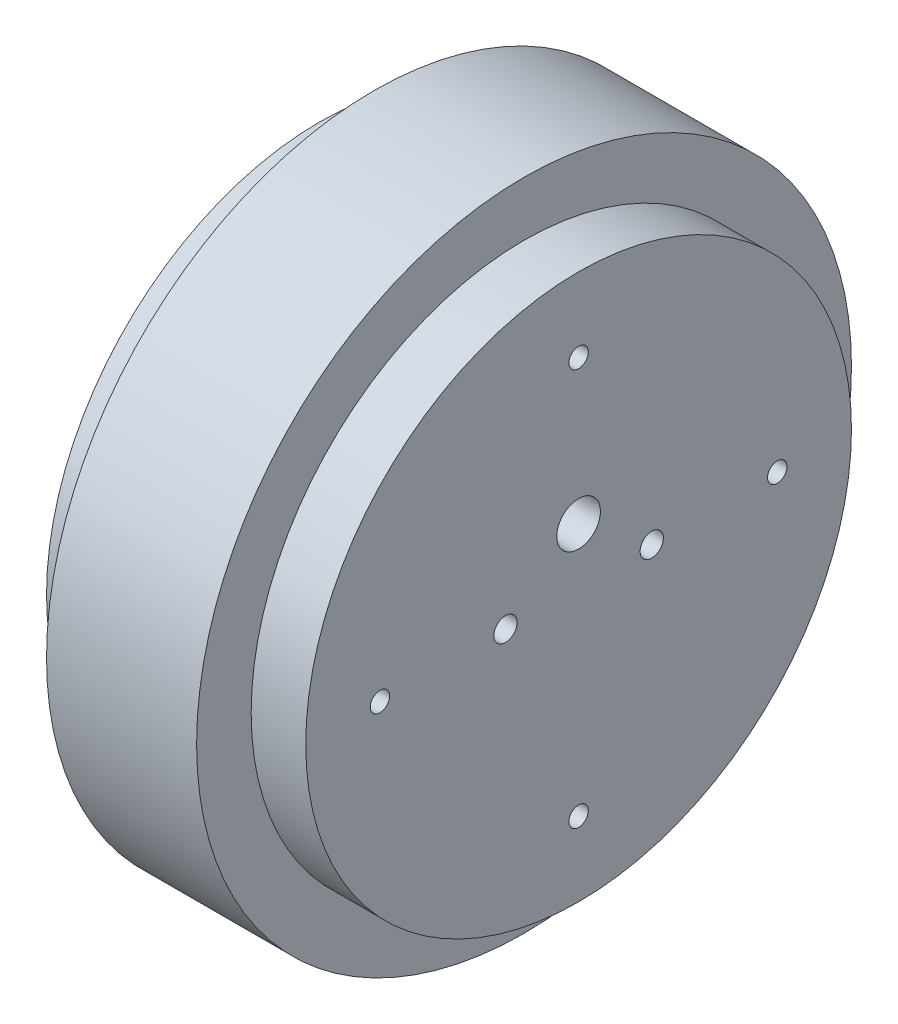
ISO-10303-21;
HEADER;
FILE_DESCRIPTION(('STEP AP214'),'2;1');
FILE_NAME('part.step','',(''),(''),'','','');
FILE_SCHEMA(('AUTOMOTIVE_DESIGN { 1 0 10303 214 1 1 1 1 }'));
ENDSEC;
DATA;
#1=APPLICATION_CONTEXT('core data for automotive mechanical design processes');
#2=APPLICATION_PROTOCOL_DEFINITION('international standard','automotive_design',2000,#1);
#3=PRODUCT_CONTEXT('',#1,'mechanical');
#4=PRODUCT('Part','Part','',(#3));
#5=PRODUCT_RELATED_PRODUCT_CATEGORY('part','',(#4));
#6=PRODUCT_DEFINITION_FORMATION('','',#4);
#7=PRODUCT_DEFINITION_CONTEXT('part definition',#1,'design');
#8=PRODUCT_DEFINITION('design','',#6,#7);
#9=PRODUCT_DEFINITION_SHAPE('','',#8);
#10=(LENGTH_UNIT() NAMED_UNIT(*) SI_UNIT(.MILLI.,.METRE.));
#11=(NAMED_UNIT(*) PLANE_ANGLE_UNIT() SI_UNIT($,.RADIAN.));
#12=(NAMED_UNIT(*) SI_UNIT($,.STERADIAN.) SOLID_ANGLE_UNIT());
#13=UNCERTAINTY_MEASURE_WITH_UNIT(LENGTH_MEASURE(1.E-05),#10,'distance_accuracy_value','');
#14=(GEOMETRIC_REPRESENTATION_CONTEXT(3) GLOBAL_UNCERTAINTY_ASSIGNED_CONTEXT((#13)) GLOBAL_UNIT_ASSIGNED_CONTEXT((#10,
#11,#12)) REPRESENTATION_CONTEXT('',''));
#15=CARTESIAN_POINT('',(0.,0.,0.));
#16=DIRECTION('',(0.,0.,1.));
#17=DIRECTION('',(1.,0.,0.));
#18=AXIS2_PLACEMENT_3D('',#15,#16,#17);
#19=CARTESIAN_POINT('',(-4.7625,0.,0.));
#20=DIRECTION('',(-1.,0.,0.));
#21=DIRECTION('',(0.,0.,1.));
#22=AXIS2_PLACEMENT_3D('',#19,#20,#21);
#23=CYLINDRICAL_SURFACE('',#22,27.5336);
#24=CARTESIAN_POINT('',(-11.1125,0.,0.));
#25=DIRECTION('',(-1.,0.,0.));
#26=DIRECTION('',(0.,0.,1.));
#27=AXIS2_PLACEMENT_3D('',#24,#25,#26);
#28=CIRCLE('',#27,27.5336);
#29=CARTESIAN_POINT('',(-11.1125,0.,27.5336));
#30=VERTEX_POINT('',#29);
#31=EDGE_CURVE('E86',#30,#30,#28,.T.);
#32=ORIENTED_EDGE('',*,*,#31,.T.);
#33=EDGE_LOOP('',(#32));
#34=FACE_BOUND('',#33,.T.);
#35=CARTESIAN_POINT('',(-9.7917,0.,0.));
#36=DIRECTION('',(-1.,0.,0.));
#37=DIRECTION('',(0.,0.,1.));
#38=AXIS2_PLACEMENT_3D('',#35,#36,#37);
#39=CIRCLE('',#38,27.5336);
#40=CARTESIAN_POINT('',(-9.7917,0.,27.5336));
#41=VERTEX_POINT('',#40);
#42=EDGE_CURVE('E10',#41,#41,#39,.T.);
#43=ORIENTED_EDGE('',*,*,#42,.F.);
#44=EDGE_LOOP('',(#43));
#45=FACE_BOUND('',#44,.T.);
#46=ADVANCED_FACE('F40',(#34,#45),#23,.F.);
#47=CARTESIAN_POINT('',(-9.7917,0.,0.));
#48=DIRECTION('',(-1.,0.,0.));
#49=DIRECTION('',(0.,0.,1.));
#50=AXIS2_PLACEMENT_3D('',#47,#48,#49);
#51=PLANE('',#50);
#52=ORIENTED_EDGE('',*,*,#42,.T.);
#53=EDGE_LOOP('',(#52));
#54=FACE_BOUND('',#53,.T.);
#55=CARTESIAN_POINT('',(-9.7917,0.,0.));
#56=DIRECTION('',(-1.,0.,0.));
#57=DIRECTION('',(0.,0.,1.));
#58=AXIS2_PLACEMENT_3D('',#55,#56,#57);
#59=CIRCLE('',#58,25.4);
#60=CARTESIAN_POINT('',(-9.7917,0.,25.4));
#61=VERTEX_POINT('',#60);
#62=EDGE_CURVE('E46',#61,#61,#59,.T.);
#63=ORIENTED_EDGE('',*,*,#62,.F.);
#64=EDGE_LOOP('',(#63));
#65=FACE_BOUND('',#64,.T.);
#66=ADVANCED_FACE('F160',(#54,#65),#51,.T.);
#67=CARTESIAN_POINT('',(-4.7625,0.,0.));
#68=DIRECTION('',(-1.,0.,0.));
#69=DIRECTION('',(0.,0.,1.));
#70=AXIS2_PLACEMENT_3D('',#67,#68,#69);
#71=CYLINDRICAL_SURFACE('',#70,25.4);
#72=ORIENTED_EDGE('',*,*,#62,.T.);
#73=EDGE_LOOP('',(#72));
#74=FACE_BOUND('',#73,.T.);
#75=CARTESIAN_POINT('',(-11.1125,0.,0.));
#76=DIRECTION('',(-1.,0.,0.));
#77=DIRECTION('',(0.,0.,1.));
#78=AXIS2_PLACEMENT_3D('',#75,#76,#77);
#79=CIRCLE('',#78,25.4);
#80=CARTESIAN_POINT('',(-11.1125,0.,25.4));
#81=VERTEX_POINT('',#80);
#82=EDGE_CURVE('E50',#81,#81,#79,.T.);
#83=ORIENTED_EDGE('',*,*,#82,.F.);
#84=EDGE_LOOP('',(#83));
#85=FACE_BOUND('',#84,.T.);
#86=ADVANCED_FACE('F154',(#74,#85),#71,.T.);
#87=CARTESIAN_POINT('',(-11.1125,0.,0.));
#88=DIRECTION('',(1.,0.,0.));
#89=DIRECTION('',(0.,0.,-1.));
#90=AXIS2_PLACEMENT_3D('',#87,#88,#89);
#91=PLANE('',#90);
#92=CARTESIAN_POINT('',(-11.1125,0.,0.));
#93=DIRECTION('',(-1.,0.,0.));
#94=DIRECTION('',(0.,0.,1.));
#95=AXIS2_PLACEMENT_3D('',#92,#93,#94);
#96=CIRCLE('',#95,22.86);
#97=CARTESIAN_POINT('',(-11.1125,0.,22.86));
#98=VERTEX_POINT('',#97);
#99=EDGE_CURVE('E54',#98,#98,#96,.T.);
#100=ORIENTED_EDGE('',*,*,#99,.F.);
#101=EDGE_LOOP('',(#100));
#102=FACE_BOUND('',#101,.T.);
#103=ORIENTED_EDGE('',*,*,#82,.T.);
#104=EDGE_LOOP('',(#103));
#105=FACE_BOUND('',#104,.T.);
#106=ADVANCED_FACE('F148',(#102,#105),#91,.F.);
#107=CARTESIAN_POINT('',(-4.7625,0.,0.));
#108=DIRECTION('',(-1.,0.,0.));
#109=DIRECTION('',(0.,0.,1.));
#110=AXIS2_PLACEMENT_3D('',#107,#108,#109);
#111=CYLINDRICAL_SURFACE('',#110,22.86);
#112=CARTESIAN_POINT('',(-4.7625,0.,0.));
#113=DIRECTION('',(-1.,0.,0.));
#114=DIRECTION('',(0.,0.,1.));
#115=AXIS2_PLACEMENT_3D('',#112,#113,#114);
#116=CIRCLE('',#115,22.86);
#117=CARTESIAN_POINT('',(-4.7625,0.,22.86));
#118=VERTEX_POINT('',#117);
#119=EDGE_CURVE('E59',#118,#118,#116,.T.);
#120=ORIENTED_EDGE('',*,*,#119,.F.);
#121=EDGE_LOOP('',(#120));
#122=FACE_BOUND('',#121,.T.);
#123=ORIENTED_EDGE('',*,*,#99,.T.);
#124=EDGE_LOOP('',(#123));
#125=FACE_BOUND('',#124,.T.);
#126=ADVANCED_FACE('F138',(#122,#125),#111,.F.);
#127=CARTESIAN_POINT('',(-4.7625,0.,0.));
#128=DIRECTION('',(1.,0.,0.));
#129=DIRECTION('',(0.,0.,-1.));
#130=AXIS2_PLACEMENT_3D('',#127,#128,#129);
#131=PLANE('',#130);
#132=CARTESIAN_POINT('',(-4.7625,0.,-8.509));
#133=DIRECTION('',(-1.,0.,0.));
#134=DIRECTION('',(0.,0.,1.));
#135=AXIS2_PLACEMENT_3D('',#132,#133,#134);
#136=CIRCLE('',#135,1.35255);
#137=CARTESIAN_POINT('',(-4.7625,0.,-7.15645));
#138=VERTEX_POINT('',#137);
#139=EDGE_CURVE('E128',#138,#138,#136,.T.);
#140=ORIENTED_EDGE('',*,*,#139,.F.);
#141=EDGE_LOOP('',(#140));
#142=FACE_BOUND('',#141,.T.);
#143=CARTESIAN_POINT('',(-4.7625,0.,8.509));
#144=DIRECTION('',(-1.,0.,0.));
#145=DIRECTION('',(0.,0.,1.));
#146=AXIS2_PLACEMENT_3D('',#143,#144,#145);
#147=CIRCLE('',#146,1.35255);
#148=CARTESIAN_POINT('',(-4.7625,0.,9.86155));
#149=VERTEX_POINT('',#148);
#150=EDGE_CURVE('E122',#149,#149,#147,.T.);
#151=ORIENTED_EDGE('',*,*,#150,.F.);
#152=EDGE_LOOP('',(#151));
#153=FACE_BOUND('',#152,.T.);
#154=CARTESIAN_POINT('',(-4.7625,6.35,0.));
#155=DIRECTION('',(-1.,0.,0.));
#156=DIRECTION('',(0.,0.,1.));
#157=AXIS2_PLACEMENT_3D('',#154,#155,#156);
#158=CIRCLE('',#157,2.54);
#159=CARTESIAN_POINT('',(-4.7625,6.35,2.54));
#160=VERTEX_POINT('',#159);
#161=EDGE_CURVE('E92',#160,#160,#158,.T.);
#162=ORIENTED_EDGE('',*,*,#161,.F.);
#163=EDGE_LOOP('',(#162));
#164=FACE_BOUND('',#163,.T.);
#165=ORIENTED_EDGE('',*,*,#119,.T.);
#166=EDGE_LOOP('',(#165));
#167=FACE_BOUND('',#166,.T.);
#168=ADVANCED_FACE('F134',(#142,#153,#164,#167),#131,.F.);
#169=CARTESIAN_POINT('',(0.,0.,0.));
#170=DIRECTION('',(-1.,0.,0.));
#171=DIRECTION('',(0.,0.,1.));
#172=AXIS2_PLACEMENT_3D('',#169,#170,#171);
#173=PLANE('',#172);
#174=CARTESIAN_POINT('',(0.,0.,-8.509));
#175=DIRECTION('',(-1.,0.,0.));
#176=DIRECTION('',(0.,0.,1.));
#177=AXIS2_PLACEMENT_3D('',#174,#175,#176);
#178=CIRCLE('',#177,1.35255);
#179=CARTESIAN_POINT('',(0.,0.,-7.15645));
#180=VERTEX_POINT('',#179);
#181=EDGE_CURVE('E125',#180,#180,#178,.T.);
#182=ORIENTED_EDGE('',*,*,#181,.T.);
#183=EDGE_LOOP('',(#182));
#184=FACE_BOUND('',#183,.T.);
#185=CARTESIAN_POINT('',(0.,0.,8.509));
#186=DIRECTION('',(-1.,0.,0.));
#187=DIRECTION('',(0.,0.,1.));
#188=AXIS2_PLACEMENT_3D('',#185,#186,#187);
#189=CIRCLE('',#188,1.35255);
#190=CARTESIAN_POINT('',(0.,0.,9.86155));
#191=VERTEX_POINT('',#190);
#192=EDGE_CURVE('E119',#191,#191,#189,.T.);
#193=ORIENTED_EDGE('',*,*,#192,.T.);
#194=EDGE_LOOP('',(#193));
#195=FACE_BOUND('',#194,.T.);
#196=CARTESIAN_POINT('',(0.,23.114,0.));
#197=DIRECTION('',(1.,0.,0.));
#198=DIRECTION('',(0.,0.,-1.));
#199=AXIS2_PLACEMENT_3D('',#196,#197,#198);
#200=CIRCLE('',#199,1.1303);
#201=CARTESIAN_POINT('',(0.,23.114,-1.1303));
#202=VERTEX_POINT('',#201);
#203=EDGE_CURVE('E116',#202,#202,#200,.T.);
#204=ORIENTED_EDGE('',*,*,#203,.F.);
#205=EDGE_LOOP('',(#204));
#206=FACE_BOUND('',#205,.T.);
#207=CARTESIAN_POINT('',(0.,0.,-23.114));
#208=DIRECTION('',(1.,0.,0.));
#209=DIRECTION('',(0.,0.,-1.));
#210=AXIS2_PLACEMENT_3D('',#207,#208,#209);
#211=CIRCLE('',#210,1.1303);
#212=CARTESIAN_POINT('',(0.,0.,-24.2443));
#213=VERTEX_POINT('',#212);
#214=EDGE_CURVE('E110',#213,#213,#211,.T.);
#215=ORIENTED_EDGE('',*,*,#214,.F.);
#216=EDGE_LOOP('',(#215));
#217=FACE_BOUND('',#216,.T.);
#218=CARTESIAN_POINT('',(0.,-23.114,0.));
#219=DIRECTION('',(1.,0.,0.));
#220=DIRECTION('',(0.,0.,-1.));
#221=AXIS2_PLACEMENT_3D('',#218,#219,#220);
#222=CIRCLE('',#221,1.1303);
#223=CARTESIAN_POINT('',(0.,-23.114,-1.1303));
#224=VERTEX_POINT('',#223);
#225=EDGE_CURVE('E104',#224,#224,#222,.T.);
#226=ORIENTED_EDGE('',*,*,#225,.F.);
#227=EDGE_LOOP('',(#226));
#228=FACE_BOUND('',#227,.T.);
#229=CARTESIAN_POINT('',(0.,0.,23.114));
#230=DIRECTION('',(1.,0.,0.));
#231=DIRECTION('',(0.,0.,-1.));
#232=AXIS2_PLACEMENT_3D('',#229,#230,#231);
#233=CIRCLE('',#232,1.1303);
#234=CARTESIAN_POINT('',(0.,0.,21.9837));
#235=VERTEX_POINT('',#234);
#236=EDGE_CURVE('E98',#235,#235,#233,.T.);
#237=ORIENTED_EDGE('',*,*,#236,.F.);
#238=EDGE_LOOP('',(#237));
#239=FACE_BOUND('',#238,.T.);
#240=CARTESIAN_POINT('',(0.,6.35,0.));
#241=DIRECTION('',(-1.,0.,0.));
#242=DIRECTION('',(0.,0.,1.));
#243=AXIS2_PLACEMENT_3D('',#240,#241,#242);
#244=CIRCLE('',#243,2.54);
#245=CARTESIAN_POINT('',(0.,6.35,2.54));
#246=VERTEX_POINT('',#245);
#247=EDGE_CURVE('E89',#246,#246,#244,.F.);
#248=ORIENTED_EDGE('',*,*,#247,.F.);
#249=EDGE_LOOP('',(#248));
#250=FACE_BOUND('',#249,.T.);
#251=CARTESIAN_POINT('',(0.,0.,0.));
#252=DIRECTION('',(-1.,0.,0.));
#253=DIRECTION('',(0.,0.,1.));
#254=AXIS2_PLACEMENT_3D('',#251,#252,#253);
#255=CIRCLE('',#254,31.75);
#256=CARTESIAN_POINT('',(0.,0.,31.75));
#257=VERTEX_POINT('',#256);
#258=EDGE_CURVE('E62',#257,#257,#255,.T.);
#259=ORIENTED_EDGE('',*,*,#258,.F.);
#260=EDGE_LOOP('',(#259));
#261=FACE_BOUND('',#260,.T.);
#262=ADVANCED_FACE('F137',(#184,#195,#206,#217,#228,#239,#250,#261),#173,.F.);
#263=CARTESIAN_POINT('',(-4.7625,0.,0.));
#264=DIRECTION('',(-1.,0.,0.));
#265=DIRECTION('',(0.,0.,1.));
#266=AXIS2_PLACEMENT_3D('',#263,#264,#265);
#267=CYLINDRICAL_SURFACE('',#266,31.75);
#268=CARTESIAN_POINT('',(-6.35,0.,0.));
#269=DIRECTION('',(-1.,0.,0.));
#270=DIRECTION('',(0.,0.,1.));
#271=AXIS2_PLACEMENT_3D('',#268,#269,#270);
#272=CIRCLE('',#271,31.75);
#273=CARTESIAN_POINT('',(-6.35,0.,31.75));
#274=VERTEX_POINT('',#273);
#275=EDGE_CURVE('E65',#274,#274,#272,.T.);
#276=ORIENTED_EDGE('',*,*,#275,.F.);
#277=EDGE_LOOP('',(#276));
#278=FACE_BOUND('',#277,.T.);
#279=ORIENTED_EDGE('',*,*,#258,.T.);
#280=EDGE_LOOP('',(#279));
#281=FACE_BOUND('',#280,.T.);
#282=ADVANCED_FACE('F210',(#278,#281),#267,.T.);
#283=CARTESIAN_POINT('',(-6.35,0.,0.));
#284=DIRECTION('',(-1.,0.,0.));
#285=DIRECTION('',(0.,0.,1.));
#286=AXIS2_PLACEMENT_3D('',#283,#284,#285);
#287=PLANE('',#286);
#288=CARTESIAN_POINT('',(-6.35,0.,0.));
#289=DIRECTION('',(-1.,0.,0.));
#290=DIRECTION('',(0.,0.,1.));
#291=AXIS2_PLACEMENT_3D('',#288,#289,#290);
#292=CIRCLE('',#291,38.1);
#293=CARTESIAN_POINT('',(-6.35,0.,38.1));
#294=VERTEX_POINT('',#293);
#295=EDGE_CURVE('E68',#294,#294,#292,.T.);
#296=ORIENTED_EDGE('',*,*,#295,.F.);
#297=EDGE_LOOP('',(#296));
#298=FACE_BOUND('',#297,.T.);
#299=ORIENTED_EDGE('',*,*,#275,.T.);
#300=EDGE_LOOP('',(#299));
#301=FACE_BOUND('',#300,.T.);
#302=ADVANCED_FACE('F204',(#298,#301),#287,.F.);
#303=CARTESIAN_POINT('',(-4.7625,0.,0.));
#304=DIRECTION('',(-1.,0.,0.));
#305=DIRECTION('',(0.,0.,1.));
#306=AXIS2_PLACEMENT_3D('',#303,#304,#305);
#307=CYLINDRICAL_SURFACE('',#306,38.1);
#308=CARTESIAN_POINT('',(-23.8125,0.,0.));
#309=DIRECTION('',(-1.,0.,0.));
#310=DIRECTION('',(0.,0.,1.));
#311=AXIS2_PLACEMENT_3D('',#308,#309,#310);
#312=CIRCLE('',#311,38.1);
#313=CARTESIAN_POINT('',(-23.8125,0.,38.1));
#314=VERTEX_POINT('',#313);
#315=EDGE_CURVE('E71',#314,#314,#312,.T.);
#316=ORIENTED_EDGE('',*,*,#315,.F.);
#317=EDGE_LOOP('',(#316));
#318=FACE_BOUND('',#317,.T.);
#319=ORIENTED_EDGE('',*,*,#295,.T.);
#320=EDGE_LOOP('',(#319));
#321=FACE_BOUND('',#320,.T.);
#322=ADVANCED_FACE('F198',(#318,#321),#307,.T.);
#323=CARTESIAN_POINT('',(-23.8125,0.,0.));
#324=DIRECTION('',(1.,0.,0.));
#325=DIRECTION('',(0.,0.,-1.));
#326=AXIS2_PLACEMENT_3D('',#323,#324,#325);
#327=PLANE('',#326);
#328=CARTESIAN_POINT('',(-23.8125,0.,0.));
#329=DIRECTION('',(-1.,0.,0.));
#330=DIRECTION('',(0.,0.,1.));
#331=AXIS2_PLACEMENT_3D('',#328,#329,#330);
#332=CIRCLE('',#331,31.75);
#333=CARTESIAN_POINT('',(-23.8125,0.,31.75));
#334=VERTEX_POINT('',#333);
#335=EDGE_CURVE('E74',#334,#334,#332,.T.);
#336=ORIENTED_EDGE('',*,*,#335,.F.);
#337=EDGE_LOOP('',(#336));
#338=FACE_BOUND('',#337,.T.);
#339=ORIENTED_EDGE('',*,*,#315,.T.);
#340=EDGE_LOOP('',(#339));
#341=FACE_BOUND('',#340,.T.);
#342=ADVANCED_FACE('F192',(#338,#341),#327,.F.);
#343=CARTESIAN_POINT('',(-4.7625,0.,0.));
#344=DIRECTION('',(-1.,0.,0.));
#345=DIRECTION('',(0.,0.,1.));
#346=AXIS2_PLACEMENT_3D('',#343,#344,#345);
#347=CYLINDRICAL_SURFACE('',#346,31.75);
#348=CARTESIAN_POINT('',(-30.1625,0.,0.));
#349=DIRECTION('',(-1.,0.,0.));
#350=DIRECTION('',(0.,0.,1.));
#351=AXIS2_PLACEMENT_3D('',#348,#349,#350);
#352=CIRCLE('',#351,31.75);
#353=CARTESIAN_POINT('',(-30.1625,0.,31.75));
#354=VERTEX_POINT('',#353);
#355=EDGE_CURVE('E77',#354,#354,#352,.T.);
#356=ORIENTED_EDGE('',*,*,#355,.F.);
#357=EDGE_LOOP('',(#356));
#358=FACE_BOUND('',#357,.T.);
#359=ORIENTED_EDGE('',*,*,#335,.T.);
#360=EDGE_LOOP('',(#359));
#361=FACE_BOUND('',#360,.T.);
#362=ADVANCED_FACE('F186',(#358,#361),#347,.T.);
#363=CARTESIAN_POINT('',(-30.1625,0.,0.));
#364=DIRECTION('',(1.,0.,0.));
#365=DIRECTION('',(0.,0.,-1.));
#366=AXIS2_PLACEMENT_3D('',#363,#364,#365);
#367=PLANE('',#366);
#368=CARTESIAN_POINT('',(-30.1625,0.,0.));
#369=DIRECTION('',(-1.,0.,0.));
#370=DIRECTION('',(0.,0.,1.));
#371=AXIS2_PLACEMENT_3D('',#368,#369,#370);
#372=CIRCLE('',#371,28.8925);
#373=CARTESIAN_POINT('',(-30.1625,0.,28.8925));
#374=VERTEX_POINT('',#373);
#375=EDGE_CURVE('E80',#374,#374,#372,.T.);
#376=ORIENTED_EDGE('',*,*,#375,.F.);
#377=EDGE_LOOP('',(#376));
#378=FACE_BOUND('',#377,.T.);
#379=ORIENTED_EDGE('',*,*,#355,.T.);
#380=EDGE_LOOP('',(#379));
#381=FACE_BOUND('',#380,.T.);
#382=ADVANCED_FACE('F180',(#378,#381),#367,.F.);
#383=CARTESIAN_POINT('',(-4.7625,0.,0.));
#384=DIRECTION('',(-1.,0.,0.));
#385=DIRECTION('',(0.,0.,1.));
#386=AXIS2_PLACEMENT_3D('',#383,#384,#385);
#387=CYLINDRICAL_SURFACE('',#386,28.8925);
#388=CARTESIAN_POINT('',(-11.1125,0.,0.));
#389=DIRECTION('',(-1.,0.,0.));
#390=DIRECTION('',(0.,0.,1.));
#391=AXIS2_PLACEMENT_3D('',#388,#389,#390);
#392=CIRCLE('',#391,28.8925);
#393=CARTESIAN_POINT('',(-11.1125,0.,28.8925));
#394=VERTEX_POINT('',#393);
#395=EDGE_CURVE('E83',#394,#394,#392,.T.);
#396=ORIENTED_EDGE('',*,*,#395,.F.);
#397=EDGE_LOOP('',(#396));
#398=FACE_BOUND('',#397,.T.);
#399=ORIENTED_EDGE('',*,*,#375,.T.);
#400=EDGE_LOOP('',(#399));
#401=FACE_BOUND('',#400,.T.);
#402=ADVANCED_FACE('F175',(#398,#401),#387,.F.);
#403=ORIENTED_EDGE('',*,*,#31,.F.);
#404=EDGE_LOOP('',(#403));
#405=FACE_BOUND('',#404,.T.);
#406=ORIENTED_EDGE('',*,*,#395,.T.);
#407=EDGE_LOOP('',(#406));
#408=FACE_BOUND('',#407,.T.);
#409=ADVANCED_FACE('F156',(#405,#408),#91,.F.);
#410=CARTESIAN_POINT('',(0.00100000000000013,6.35,0.));
#411=DIRECTION('',(-1.,0.,0.));
#412=DIRECTION('',(0.,0.,1.));
#413=AXIS2_PLACEMENT_3D('',#410,#411,#412);
#414=CYLINDRICAL_SURFACE('',#413,2.54);
#415=ORIENTED_EDGE('',*,*,#161,.T.);
#416=EDGE_LOOP('',(#415));
#417=FACE_BOUND('',#416,.T.);
#418=ORIENTED_EDGE('',*,*,#247,.T.);
#419=EDGE_LOOP('',(#418));
#420=FACE_BOUND('',#419,.T.);
#421=ADVANCED_FACE('F174',(#417,#420),#414,.F.);
#422=CARTESIAN_POINT('',(-4.318,0.,23.114));
#423=DIRECTION('',(-1.,0.,0.));
#424=DIRECTION('',(0.,0.,1.));
#425=AXIS2_PLACEMENT_3D('',#422,#423,#424);
#426=PLANE('',#425);
#427=CARTESIAN_POINT('',(-4.318,0.,23.114));
#428=DIRECTION('',(1.,0.,0.));
#429=DIRECTION('',(0.,0.,-1.));
#430=AXIS2_PLACEMENT_3D('',#427,#428,#429);
#431=CIRCLE('',#430,1.1303);
#432=CARTESIAN_POINT('',(-4.318,0.,21.9837));
#433=VERTEX_POINT('',#432);
#434=EDGE_CURVE('E95',#433,#433,#431,.T.);
#435=ORIENTED_EDGE('',*,*,#434,.T.);
#436=EDGE_LOOP('',(#435));
#437=FACE_BOUND('',#436,.T.);
#438=ADVANCED_FACE('F228',(#437),#426,.F.);
#439=CARTESIAN_POINT('',(0.,0.,23.114));
#440=DIRECTION('',(1.,0.,0.));
#441=DIRECTION('',(0.,0.,-1.));
#442=AXIS2_PLACEMENT_3D('',#439,#440,#441);
#443=CYLINDRICAL_SURFACE('',#442,1.1303);
#444=ORIENTED_EDGE('',*,*,#434,.F.);
#445=EDGE_LOOP('',(#444));
#446=FACE_BOUND('',#445,.T.);
#447=ORIENTED_EDGE('',*,*,#236,.T.);
#448=EDGE_LOOP('',(#447));
#449=FACE_BOUND('',#448,.T.);
#450=ADVANCED_FACE('F232',(#446,#449),#443,.F.);
#451=CARTESIAN_POINT('',(-4.318,-23.114,0.));
#452=DIRECTION('',(-1.,0.,0.));
#453=DIRECTION('',(0.,0.,1.));
#454=AXIS2_PLACEMENT_3D('',#451,#452,#453);
#455=PLANE('',#454);
#456=CARTESIAN_POINT('',(-4.318,-23.114,0.));
#457=DIRECTION('',(1.,0.,0.));
#458=DIRECTION('',(0.,0.,-1.));
#459=AXIS2_PLACEMENT_3D('',#456,#457,#458);
#460=CIRCLE('',#459,1.1303);
#461=CARTESIAN_POINT('',(-4.318,-23.114,-1.1303));
#462=VERTEX_POINT('',#461);
#463=EDGE_CURVE('E101',#462,#462,#460,.T.);
#464=ORIENTED_EDGE('',*,*,#463,.T.);
#465=EDGE_LOOP('',(#464));
#466=FACE_BOUND('',#465,.T.);
#467=ADVANCED_FACE('F236',(#466),#455,.F.);
#468=CARTESIAN_POINT('',(0.,-23.114,0.));
#469=DIRECTION('',(1.,0.,0.));
#470=DIRECTION('',(0.,0.,-1.));
#471=AXIS2_PLACEMENT_3D('',#468,#469,#470);
#472=CYLINDRICAL_SURFACE('',#471,1.1303);
#473=ORIENTED_EDGE('',*,*,#463,.F.);
#474=EDGE_LOOP('',(#473));
#475=FACE_BOUND('',#474,.T.);
#476=ORIENTED_EDGE('',*,*,#225,.T.);
#477=EDGE_LOOP('',(#476));
#478=FACE_BOUND('',#477,.T.);
#479=ADVANCED_FACE('F240',(#475,#478),#472,.F.);
#480=CARTESIAN_POINT('',(-4.318,0.,-23.114));
#481=DIRECTION('',(-1.,0.,0.));
#482=DIRECTION('',(0.,0.,1.));
#483=AXIS2_PLACEMENT_3D('',#480,#481,#482);
#484=PLANE('',#483);
#485=CARTESIAN_POINT('',(-4.318,0.,-23.114));
#486=DIRECTION('',(1.,0.,0.));
#487=DIRECTION('',(0.,0.,-1.));
#488=AXIS2_PLACEMENT_3D('',#485,#486,#487);
#489=CIRCLE('',#488,1.1303);
#490=CARTESIAN_POINT('',(-4.318,0.,-24.2443));
#491=VERTEX_POINT('',#490);
#492=EDGE_CURVE('E107',#491,#491,#489,.T.);
#493=ORIENTED_EDGE('',*,*,#492,.T.);
#494=EDGE_LOOP('',(#493));
#495=FACE_BOUND('',#494,.T.);
#496=ADVANCED_FACE('F244',(#495),#484,.F.);
#497=CARTESIAN_POINT('',(0.,0.,-23.114));
#498=DIRECTION('',(1.,0.,0.));
#499=DIRECTION('',(0.,0.,-1.));
#500=AXIS2_PLACEMENT_3D('',#497,#498,#499);
#501=CYLINDRICAL_SURFACE('',#500,1.1303);
#502=ORIENTED_EDGE('',*,*,#492,.F.);
#503=EDGE_LOOP('',(#502));
#504=FACE_BOUND('',#503,.T.);
#505=ORIENTED_EDGE('',*,*,#214,.T.);
#506=EDGE_LOOP('',(#505));
#507=FACE_BOUND('',#506,.T.);
#508=ADVANCED_FACE('F248',(#504,#507),#501,.F.);
#509=CARTESIAN_POINT('',(-4.318,23.114,0.));
#510=DIRECTION('',(-1.,0.,0.));
#511=DIRECTION('',(0.,0.,1.));
#512=AXIS2_PLACEMENT_3D('',#509,#510,#511);
#513=PLANE('',#512);
#514=CARTESIAN_POINT('',(-4.318,23.114,0.));
#515=DIRECTION('',(1.,0.,0.));
#516=DIRECTION('',(0.,0.,-1.));
#517=AXIS2_PLACEMENT_3D('',#514,#515,#516);
#518=CIRCLE('',#517,1.1303);
#519=CARTESIAN_POINT('',(-4.318,23.114,-1.1303));
#520=VERTEX_POINT('',#519);
#521=EDGE_CURVE('E113',#520,#520,#518,.T.);
#522=ORIENTED_EDGE('',*,*,#521,.T.);
#523=EDGE_LOOP('',(#522));
#524=FACE_BOUND('',#523,.T.);
#525=ADVANCED_FACE('F252',(#524),#513,.F.);
#526=CARTESIAN_POINT('',(0.,23.114,0.));
#527=DIRECTION('',(1.,0.,0.));
#528=DIRECTION('',(0.,0.,-1.));
#529=AXIS2_PLACEMENT_3D('',#526,#527,#528);
#530=CYLINDRICAL_SURFACE('',#529,1.1303);
#531=ORIENTED_EDGE('',*,*,#521,.F.);
#532=EDGE_LOOP('',(#531));
#533=FACE_BOUND('',#532,.T.);
#534=ORIENTED_EDGE('',*,*,#203,.T.);
#535=EDGE_LOOP('',(#534));
#536=FACE_BOUND('',#535,.T.);
#537=ADVANCED_FACE('F256',(#533,#536),#530,.F.);
#538=CARTESIAN_POINT('',(-4.7625,0.,8.509));
#539=DIRECTION('',(-1.,0.,0.));
#540=DIRECTION('',(0.,0.,1.));
#541=AXIS2_PLACEMENT_3D('',#538,#539,#540);
#542=CYLINDRICAL_SURFACE('',#541,1.35255);
#543=ORIENTED_EDGE('',*,*,#192,.F.);
#544=EDGE_LOOP('',(#543));
#545=FACE_BOUND('',#544,.T.);
#546=ORIENTED_EDGE('',*,*,#150,.T.);
#547=EDGE_LOOP('',(#546));
#548=FACE_BOUND('',#547,.T.);
#549=ADVANCED_FACE('F260',(#545,#548),#542,.F.);
#550=CARTESIAN_POINT('',(-4.7625,0.,-8.509));
#551=DIRECTION('',(-1.,0.,0.));
#552=DIRECTION('',(0.,0.,1.));
#553=AXIS2_PLACEMENT_3D('',#550,#551,#552);
#554=CYLINDRICAL_SURFACE('',#553,1.35255);
#555=ORIENTED_EDGE('',*,*,#181,.F.);
#556=EDGE_LOOP('',(#555));
#557=FACE_BOUND('',#556,.T.);
#558=ORIENTED_EDGE('',*,*,#139,.T.);
#559=EDGE_LOOP('',(#558));
#560=FACE_BOUND('',#559,.T.);
#561=ADVANCED_FACE('F132',(#557,#560),#554,.F.);
#562=CLOSED_SHELL('',(#46,#66,#86,#106,#126,#168,#262,#282,#302,#322,#342,#362,#382,#402,#409,
#421,#438,#450,#467,#479,#496,#508,#525,#537,#549,#561));
#563=MANIFOLD_SOLID_BREP('B2',#562);
#564=ADVANCED_BREP_SHAPE_REPRESENTATION('',(#18,#563),#14);
#565=SHAPE_DEFINITION_REPRESENTATION(#9,#564);
ENDSEC;
END-ISO-10303-21;
